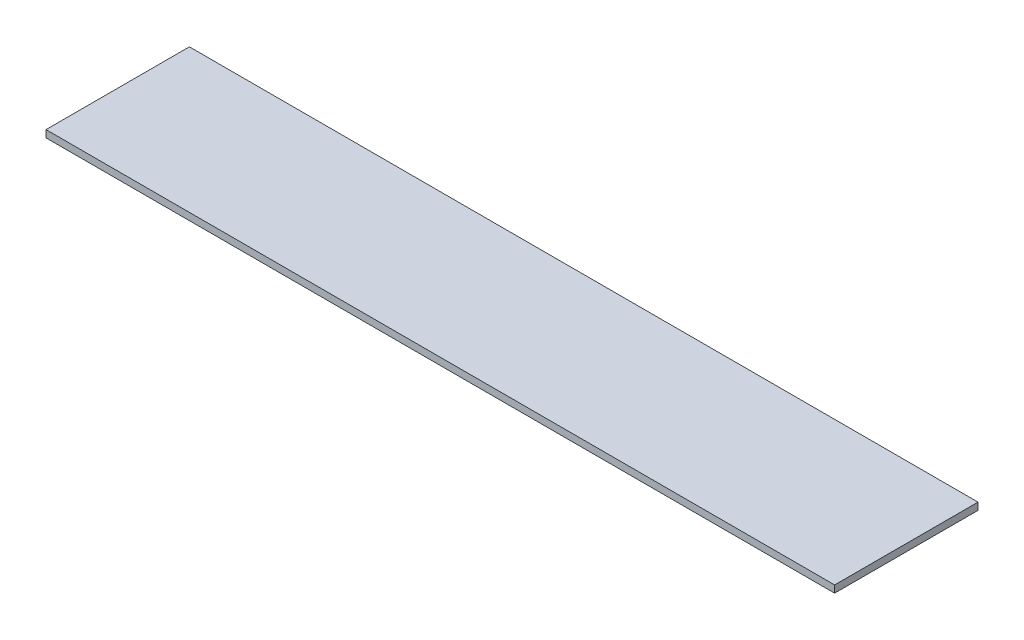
from build123d import *

# Parameters (mm, degrees)
ESQUISSE1_W        = 550
ESQUISSE1_H        = 100
BOSS_EXTRU_1_DEPTH = 5


with BuildPart() as part:
    # Esquisse1 → Boss.-Extru.1 (new body)
    with BuildSketch(Plane(origin=(0, 0, 0), x_dir=(1, 0, 0), z_dir=(0, 1, 0))):
        Rectangle(ESQUISSE1_W, ESQUISSE1_H)
    extrude(amount=-BOSS_EXTRU_1_DEPTH)


solid = part.part
